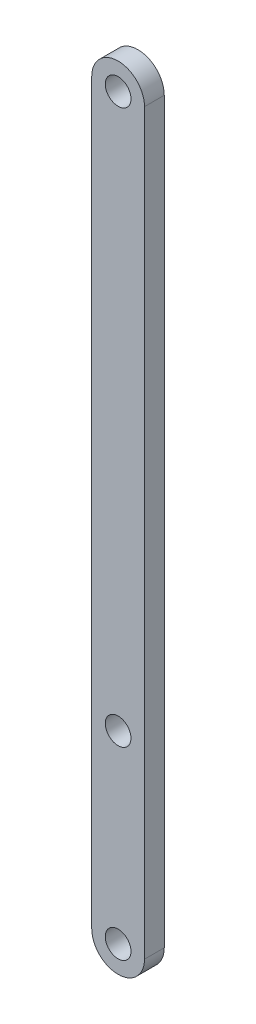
from build123d import *

# Parameters (mm, degrees)
EXTRUDE_1_DEPTH         = 3
HOLE_WIZARD_3_9_3_9_1_D = 3.9


with BuildPart() as part:
    # Sketch 1 → Extrude 1 (new body)
    with BuildSketch(Plane.XY):
        with BuildLine():
            Line((-4, 0), (-4, 112))
            ThreePointArc((-4, 112), (0, 116), (4, 112))
            Line((4, 112), (4, 0))
            ThreePointArc((4, 0), (0, -4), (-4, 0))
        make_face()
    extrude(amount=EXTRUDE_1_DEPTH)

    # Hole Wizard 3.9 _3.9_ _1 (through all)
    with Locations(Plane.XY.offset(3)):
        with Locations((0, 112), (0, 0), (0, 28)):
            Hole(HOLE_WIZARD_3_9_3_9_1_D / 2)


solid = part.part
